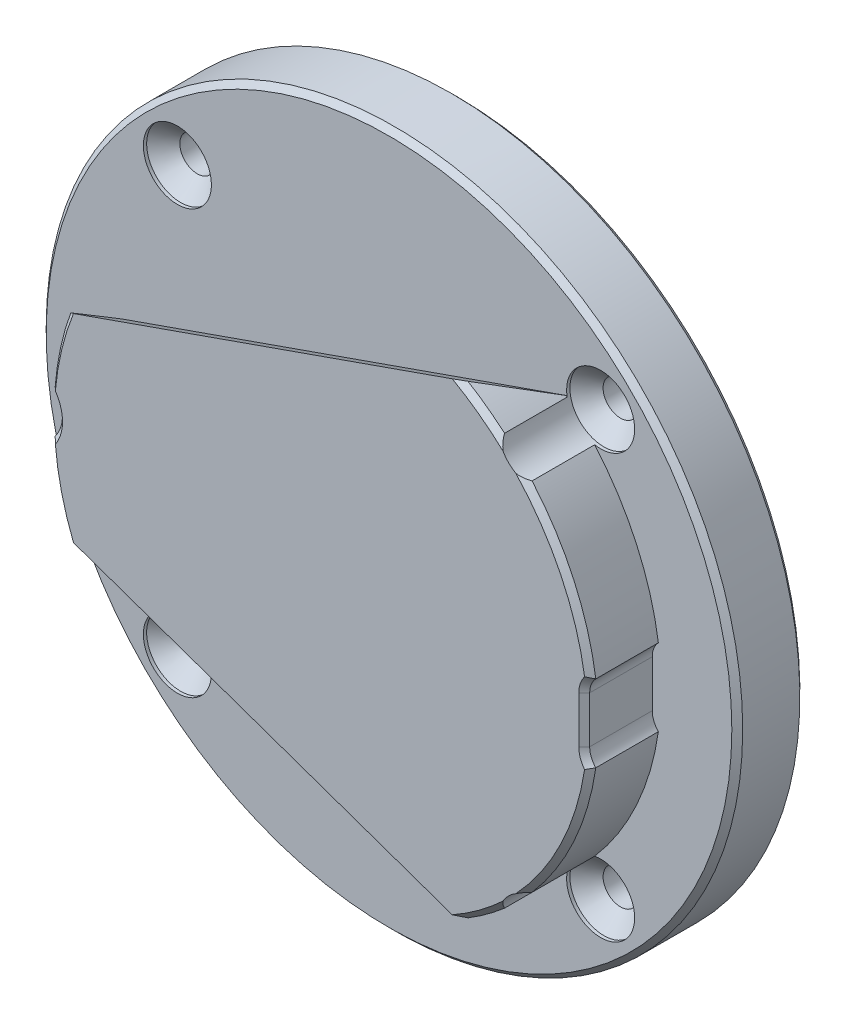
ISO-10303-21;
HEADER;
FILE_DESCRIPTION(('STEP AP214'),'2;1');
FILE_NAME('part.step','',(''),(''),'','','');
FILE_SCHEMA(('AUTOMOTIVE_DESIGN { 1 0 10303 214 1 1 1 1 }'));
ENDSEC;
DATA;
#1=APPLICATION_CONTEXT('core data for automotive mechanical design processes');
#2=APPLICATION_PROTOCOL_DEFINITION('international standard','automotive_design',2000,#1);
#3=PRODUCT_CONTEXT('',#1,'mechanical');
#4=PRODUCT('Part','Part','',(#3));
#5=PRODUCT_RELATED_PRODUCT_CATEGORY('part','',(#4));
#6=PRODUCT_DEFINITION_FORMATION('','',#4);
#7=PRODUCT_DEFINITION_CONTEXT('part definition',#1,'design');
#8=PRODUCT_DEFINITION('design','',#6,#7);
#9=PRODUCT_DEFINITION_SHAPE('','',#8);
#10=(LENGTH_UNIT() NAMED_UNIT(*) SI_UNIT(.MILLI.,.METRE.));
#11=(NAMED_UNIT(*) PLANE_ANGLE_UNIT() SI_UNIT($,.RADIAN.));
#12=(NAMED_UNIT(*) SI_UNIT($,.STERADIAN.) SOLID_ANGLE_UNIT());
#13=UNCERTAINTY_MEASURE_WITH_UNIT(LENGTH_MEASURE(1.E-05),#10,'distance_accuracy_value','');
#14=(GEOMETRIC_REPRESENTATION_CONTEXT(3) GLOBAL_UNCERTAINTY_ASSIGNED_CONTEXT((#13)) GLOBAL_UNIT_ASSIGNED_CONTEXT((#10,
#11,#12)) REPRESENTATION_CONTEXT('',''));
#15=CARTESIAN_POINT('',(0.,0.,0.));
#16=DIRECTION('',(0.,0.,1.));
#17=DIRECTION('',(1.,0.,0.));
#18=AXIS2_PLACEMENT_3D('',#15,#16,#17);
#19=CARTESIAN_POINT('',(0.,0.,24.));
#20=DIRECTION('',(0.,0.,-1.));
#21=DIRECTION('',(1.,0.,0.));
#22=AXIS2_PLACEMENT_3D('',#19,#20,#21);
#23=CONICAL_SURFACE('',#22,50.,0.785398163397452);
#24=CARTESIAN_POINT('',(0.,0.,25.));
#25=DIRECTION('',(0.,0.,-1.));
#26=DIRECTION('',(1.,0.,0.));
#27=AXIS2_PLACEMENT_3D('',#24,#25,#26);
#28=CIRCLE('',#27,49.);
#29=CARTESIAN_POINT('',(35.7963715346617,-33.4607200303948,25.));
#30=VERTEX_POINT('',#29);
#31=CARTESIAN_POINT('',(48.4413110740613,-7.37830477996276,25.));
#32=VERTEX_POINT('',#31);
#33=EDGE_CURVE('E181',#30,#32,#28,.F.);
#34=ORIENTED_EDGE('',*,*,#33,.F.);
#35=CARTESIAN_POINT('',(35.7957855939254,-33.4610539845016,25.0002));
#36=CARTESIAN_POINT('',(35.9312403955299,-33.3838387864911,24.9539765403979));
#37=CARTESIAN_POINT('',(36.0679208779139,-33.3126483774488,24.9020619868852));
#38=CARTESIAN_POINT('',(36.3424890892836,-33.1819920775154,24.7881995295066));
#39=CARTESIAN_POINT('',(36.4803751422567,-33.122511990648,24.7262639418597));
#40=CARTESIAN_POINT('',(36.8900161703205,-32.9626341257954,24.529397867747));
#41=CARTESIAN_POINT('',(37.1622002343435,-32.8783363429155,24.3818270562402));
#42=CARTESIAN_POINT('',(37.4914610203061,-32.7992380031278,24.1863763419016));
#43=CARTESIAN_POINT('',(37.5516390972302,-32.7857336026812,24.1499495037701));
#44=CARTESIAN_POINT('',(37.6718922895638,-32.7605908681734,24.0758036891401));
#45=CARTESIAN_POINT('',(37.7319662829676,-32.7489593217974,24.0380805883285));
#46=CARTESIAN_POINT('',(37.7918878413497,-32.7382530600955,23.9998));
#47=B_SPLINE_CURVE_WITH_KNOTS('',3,(#35,#36,#37,#38,#39,#40,#41,#42,#43,#44,#45,#46),
.UNSPECIFIED.,.F.,.F.,(4,2,2,2,2,4),(0.,0.4872876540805,0.973980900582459,1.93162304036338,
2.14650814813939,2.3621553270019),.UNSPECIFIED.);
#48=CARTESIAN_POINT('',(37.7915747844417,-32.7383089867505,24.0000000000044));
#49=VERTEX_POINT('',#48);
#50=EDGE_CURVE('E161',#30,#49,#47,.T.);
#51=ORIENTED_EDGE('',*,*,#50,.T.);
#52=CARTESIAN_POINT('',(0.,0.,24.));
#53=DIRECTION('',(0.,0.,1.));
#54=DIRECTION('',(-1.,0.,0.));
#55=AXIS2_PLACEMENT_3D('',#52,#53,#54);
#56=CIRCLE('',#55,50.);
#57=CARTESIAN_POINT('',(49.4975621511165,-7.07045550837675,24.0000000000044));
#58=VERTEX_POINT('',#57);
#59=EDGE_CURVE('E404',#58,#49,#56,.F.);
#60=ORIENTED_EDGE('',*,*,#59,.F.);
#61=CARTESIAN_POINT('',(49.4975621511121,-7.07045550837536,24.0000000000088));
#62=CARTESIAN_POINT('',(49.4098575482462,-7.09883563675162,24.0828098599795));
#63=CARTESIAN_POINT('',(49.3220559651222,-7.12645947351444,24.1657738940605));
#64=CARTESIAN_POINT('',(49.1462941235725,-7.1803070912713,24.3319671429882));
#65=CARTESIAN_POINT('',(49.0583338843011,-7.20653103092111,24.4151963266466));
#66=CARTESIAN_POINT('',(48.8822725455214,-7.25769706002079,24.5818932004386));
#67=CARTESIAN_POINT('',(48.7941714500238,-7.28263918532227,24.6653608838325));
#68=CARTESIAN_POINT('',(48.6178348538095,-7.33133836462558,24.8325208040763));
#69=CARTESIAN_POINT('',(48.5295993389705,-7.3550952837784,24.9162130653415));
#70=CARTESIAN_POINT('',(48.4413110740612,-7.37830477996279,25.));
#71=B_SPLINE_CURVE_WITH_KNOTS('',3,(#61,#62,#63,#64,#65,#66,#67,#68,#69,#70),.UNSPECIFIED.,.F.,
.F.,(4,2,2,2,4),(0.,0.371741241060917,0.743440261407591,1.11512887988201,1.48685969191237),.UNSPECIFIED.);
#72=EDGE_CURVE('E194',#58,#32,#71,.T.);
#73=ORIENTED_EDGE('',*,*,#72,.T.);
#74=EDGE_LOOP('',(#34,#51,#60,#73));
#75=FACE_BOUND('',#74,.T.);
#76=ADVANCED_FACE('F14',(#75),#23,.T.);
#77=CARTESIAN_POINT('',(32.7383089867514,-37.7915747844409,24.0000000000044));
#78=VERTEX_POINT('',#77);
#79=CARTESIAN_POINT('',(26.0126281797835,-42.7006226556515,24.));
#80=VERTEX_POINT('',#79);
#81=EDGE_CURVE('E173',#78,#80,#56,.F.);
#82=ORIENTED_EDGE('',*,*,#81,.F.);
#83=CARTESIAN_POINT('',(32.7382530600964,-37.7918878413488,23.9998));
#84=CARTESIAN_POINT('',(32.762413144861,-37.6566441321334,24.0861999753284));
#85=CARTESIAN_POINT('',(32.791346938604,-37.5204117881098,24.1698847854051));
#86=CARTESIAN_POINT('',(32.8594581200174,-37.2463260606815,24.3309026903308));
#87=CARTESIAN_POINT('',(32.8986593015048,-37.1084696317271,24.4082204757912));
#88=CARTESIAN_POINT('',(32.9870550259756,-36.8347297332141,24.5537864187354));
#89=CARTESIAN_POINT('',(33.0360477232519,-36.6988579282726,24.6221778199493));
#90=CARTESIAN_POINT('',(33.1449285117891,-36.4275531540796,24.7502722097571));
#91=CARTESIAN_POINT('',(33.2048025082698,-36.2921198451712,24.8099862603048));
#92=CARTESIAN_POINT('',(33.2997327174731,-36.0969176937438,24.8893520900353));
#93=CARTESIAN_POINT('',(33.3303053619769,-36.0365403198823,24.9129612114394));
#94=CARTESIAN_POINT('',(33.3938750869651,-35.9159478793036,24.9581601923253));
#95=CARTESIAN_POINT('',(33.4268818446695,-35.8557345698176,24.9797411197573));
#96=CARTESIAN_POINT('',(33.4610539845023,-35.7957855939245,25.0002));
#97=B_SPLINE_CURVE_WITH_KNOTS('',3,(#83,#84,#85,#86,#87,#88,#89,#90,#91,#92,#93,#94,#95,#96),
.UNSPECIFIED.,.F.,.F.,(4,2,2,2,2,2,4),(0.,0.486924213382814,0.974986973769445,1.4538692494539,
1.9321355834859,2.14710549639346,2.36298164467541),.UNSPECIFIED.);
#98=CARTESIAN_POINT('',(33.4607200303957,-35.7963715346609,25.));
#99=VERTEX_POINT('',#98);
#100=EDGE_CURVE('E159',#78,#99,#97,.T.);
#101=ORIENTED_EDGE('',*,*,#100,.T.);
#102=CARTESIAN_POINT('',(24.1242545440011,-42.6499747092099,25.));
#103=VERTEX_POINT('',#102);
#104=EDGE_CURVE('E171',#103,#99,#28,.F.);
#105=ORIENTED_EDGE('',*,*,#104,.F.);
#106=CARTESIAN_POINT('',(26.0126281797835,-42.7006226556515,24.));
#107=CARTESIAN_POINT('',(25.062004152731,-42.6803222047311,24.5119014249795));
#108=CARTESIAN_POINT('',(24.124254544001,-42.6499747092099,25.));
#109=B_SPLINE_CURVE_WITH_KNOTS('',2,(#106,#107,#108),.UNSPECIFIED.,.F.,.F.,(3,3),(0.,1.),.UNSPECIFIED.);
#110=EDGE_CURVE('E457',#80,#103,#109,.T.);
#111=ORIENTED_EDGE('',*,*,#110,.F.);
#112=EDGE_LOOP('',(#82,#101,#105,#111));
#113=FACE_BOUND('',#112,.T.);
#114=ADVANCED_FACE('F169',(#113),#23,.T.);
#115=CARTESIAN_POINT('',(0.,0.,12.5));
#116=DIRECTION('',(0.,0.,1.));
#117=DIRECTION('',(-1.,0.,0.));
#118=AXIS2_PLACEMENT_3D('',#115,#116,#117);
#119=CYLINDRICAL_SURFACE('',#118,50.);
#120=ORIENTED_EDGE('',*,*,#59,.T.);
#121=DIRECTION('',(0.,0.,-1.));
#122=VECTOR('',#121,1.);
#123=CARTESIAN_POINT('',(37.7915747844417,-32.7383089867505,18.45));
#124=LINE('',#123,#122);
#125=CARTESIAN_POINT('',(37.7915747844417,-32.7383089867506,12.5));
#126=VERTEX_POINT('',#125);
#127=EDGE_CURVE('E174',#49,#126,#124,.T.);
#128=ORIENTED_EDGE('',*,*,#127,.T.);
#129=CARTESIAN_POINT('',(0.,0.,12.5));
#130=DIRECTION('',(0.,0.,1.));
#131=DIRECTION('',(-1.,0.,0.));
#132=AXIS2_PLACEMENT_3D('',#129,#130,#131);
#133=CIRCLE('',#132,50.);
#134=CARTESIAN_POINT('',(49.4975621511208,-7.07045550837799,12.5));
#135=VERTEX_POINT('',#134);
#136=EDGE_CURVE('E383',#126,#135,#133,.T.);
#137=ORIENTED_EDGE('',*,*,#136,.T.);
#138=DIRECTION('',(0.,0.,1.));
#139=VECTOR('',#138,1.);
#140=CARTESIAN_POINT('',(49.497562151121,-7.07045550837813,-170.329529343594));
#141=LINE('',#140,#139);
#142=EDGE_CURVE('E360',#135,#58,#141,.T.);
#143=ORIENTED_EDGE('',*,*,#142,.T.);
#144=EDGE_LOOP('',(#120,#128,#137,#143));
#145=FACE_BOUND('',#144,.T.);
#146=ADVANCED_FACE('F474',(#145),#119,.T.);
#147=CARTESIAN_POINT('',(32.5467180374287,-37.9567009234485,12.5));
#148=VERTEX_POINT('',#147);
#149=CARTESIAN_POINT('',(32.7383089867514,-37.7915747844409,12.5));
#150=VERTEX_POINT('',#149);
#151=EDGE_CURVE('E380',#148,#150,#133,.T.);
#152=ORIENTED_EDGE('',*,*,#151,.T.);
#153=DIRECTION('',(0.,0.,-1.));
#154=VECTOR('',#153,1.);
#155=CARTESIAN_POINT('',(32.7383089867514,-37.7915747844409,18.45));
#156=LINE('',#155,#154);
#157=EDGE_CURVE('E29',#150,#78,#156,.F.);
#158=ORIENTED_EDGE('',*,*,#157,.T.);
#159=ORIENTED_EDGE('',*,*,#81,.T.);
#160=CARTESIAN_POINT('',(0.,0.,-30.8739189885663));
#161=DIRECTION('',(-0.28669600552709,-0.817193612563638,-0.5));
#162=DIRECTION('',(-0.165524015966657,-0.471806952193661,0.866025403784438));
#163=AXIS2_PLACEMENT_3D('',#160,#161,#162);
#164=ELLIPSE('',#163,100.,50.);
#165=EDGE_CURVE('E401',#80,#148,#164,.F.);
#166=ORIENTED_EDGE('',*,*,#165,.T.);
#167=EDGE_LOOP('',(#152,#158,#159,#166));
#168=FACE_BOUND('',#167,.T.);
#169=ADVANCED_FACE('F292',(#168),#119,.T.);
#170=CARTESIAN_POINT('',(0.,0.,23.9999999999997));
#171=DIRECTION('',(0.,0.,-1.));
#172=DIRECTION('',(0.,-1.,0.));
#173=AXIS2_PLACEMENT_3D('',#170,#171,#172);
#174=CONICAL_SURFACE('',#173,50.,0.785398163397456);
#175=CARTESIAN_POINT('',(0.,0.,24.));
#176=DIRECTION('',(0.,0.,1.));
#177=DIRECTION('',(-1.,0.,0.));
#178=AXIS2_PLACEMENT_3D('',#175,#176,#177);
#179=CIRCLE('',#178,50.);
#180=CARTESIAN_POINT('',(37.7915747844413,32.7383089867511,24.0000000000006));
#181=VERTEX_POINT('',#180);
#182=CARTESIAN_POINT('',(49.4975621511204,7.07045550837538,24.0000000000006));
#183=VERTEX_POINT('',#182);
#184=EDGE_CURVE('E352',#181,#183,#179,.F.);
#185=ORIENTED_EDGE('',*,*,#184,.F.);
#186=CARTESIAN_POINT('',(39.3569480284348,32.6582752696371,22.8577249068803));
#187=CARTESIAN_POINT('',(39.1988529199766,32.6464778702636,22.9869133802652));
#188=CARTESIAN_POINT('',(39.038438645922,32.640509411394,23.1139331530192));
#189=CARTESIAN_POINT('',(38.7130441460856,32.6412731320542,23.3626498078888));
#190=CARTESIAN_POINT('',(38.5480549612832,32.6480322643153,23.4843348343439));
#191=CARTESIAN_POINT('',(38.2122391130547,32.6755180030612,23.7222677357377));
#192=CARTESIAN_POINT('',(38.0413659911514,32.6964124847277,23.8384320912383));
#193=CARTESIAN_POINT('',(37.6966570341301,32.753537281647,24.0618972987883));
#194=CARTESIAN_POINT('',(37.5228239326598,32.7897541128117,24.1692058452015));
#195=CARTESIAN_POINT('',(37.1010931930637,32.897219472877,24.414981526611));
#196=CARTESIAN_POINT('',(36.85204526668,32.9767425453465,24.5481894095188));
#197=CARTESIAN_POINT('',(36.4796082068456,33.123199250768,24.7263361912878));
#198=CARTESIAN_POINT('',(36.3558371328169,33.1764463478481,24.7820399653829));
#199=CARTESIAN_POINT('',(36.1093405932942,33.2922936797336,24.8853846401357));
#200=CARTESIAN_POINT('',(35.9866145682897,33.3548885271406,24.9330301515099));
#201=CARTESIAN_POINT('',(35.753967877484,33.4836177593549,25.0154683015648));
#202=CARTESIAN_POINT('',(35.6438742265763,33.5489501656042,25.0510247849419));
#203=CARTESIAN_POINT('',(35.4263259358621,33.6874103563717,25.1139021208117));
#204=CARTESIAN_POINT('',(35.3188699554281,33.7605340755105,25.1412272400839));
#205=CARTESIAN_POINT('',(35.1074531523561,33.9143945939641,25.1870626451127));
#206=CARTESIAN_POINT('',(35.0034948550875,33.9951367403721,25.2055666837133));
#207=CARTESIAN_POINT('',(34.800176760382,34.1637026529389,25.2332732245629));
#208=CARTESIAN_POINT('',(34.7008167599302,34.2515261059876,25.2424761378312));
#209=CARTESIAN_POINT('',(34.5076962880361,34.4335348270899,25.2513400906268));
#210=CARTESIAN_POINT('',(34.4139344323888,34.5277185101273,25.2510034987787));
#211=CARTESIAN_POINT('',(34.2328326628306,34.721609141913,25.240801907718));
#212=CARTESIAN_POINT('',(34.1454937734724,34.8213169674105,25.230935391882));
#213=CARTESIAN_POINT('',(33.9780800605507,35.0250832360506,25.2019547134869));
#214=CARTESIAN_POINT('',(33.8979936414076,35.1291343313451,25.1828556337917));
#215=CARTESIAN_POINT('',(33.7454219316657,35.3406858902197,25.1358911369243));
#216=CARTESIAN_POINT('',(33.6729322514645,35.4481843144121,25.1080308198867));
#217=CARTESIAN_POINT('',(33.5794412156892,35.5964261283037,25.0645080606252));
#218=CARTESIAN_POINT('',(33.5550346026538,35.6361094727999,25.0523683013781));
#219=CARTESIAN_POINT('',(33.5072651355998,35.7157473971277,25.0270540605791));
#220=CARTESIAN_POINT('',(33.4839018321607,35.7557018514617,25.0138800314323));
#221=CARTESIAN_POINT('',(33.3847238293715,35.92969747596,24.9544977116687));
#222=CARTESIAN_POINT('',(33.3141466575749,36.0650523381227,24.9031479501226));
#223=CARTESIAN_POINT('',(33.1844100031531,36.337135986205,24.7905200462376));
#224=CARTESIAN_POINT('',(33.1252625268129,36.4738660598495,24.7292315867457));
#225=CARTESIAN_POINT('',(32.9642346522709,36.8848829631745,24.532172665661));
#226=CARTESIAN_POINT('',(32.8789404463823,37.1596876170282,24.383318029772));
#227=CARTESIAN_POINT('',(32.7991982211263,37.491626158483,24.1862784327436));
#228=CARTESIAN_POINT('',(32.7856605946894,37.5519661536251,24.1497513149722));
#229=CARTESIAN_POINT('',(32.7605259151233,37.6722251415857,24.075594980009));
#230=CARTESIAN_POINT('',(32.7489251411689,37.7321447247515,24.0379680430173));
#231=CARTESIAN_POINT('',(32.7081762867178,37.9602598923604,23.8922322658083));
#232=CARTESIAN_POINT('',(32.6854757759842,38.1272303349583,23.7803667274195));
#233=CARTESIAN_POINT('',(32.653632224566,38.458371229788,23.5491142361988));
#234=CARTESIAN_POINT('',(32.6445512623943,38.6225255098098,23.4296954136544));
#235=CARTESIAN_POINT('',(32.6417780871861,38.7845094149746,23.307556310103));
#236=B_SPLINE_CURVE_WITH_KNOTS('',3,(#186,#187,#188,#189,#190,#191,#192,#193,#194,#195,#196,
#197,#198,#199,#200,#201,#202,#203,#204,#205,#206,#207,#208,#209,#210,#211,#212,#213,#214,#215,
#216,#217,#218,#219,#220,#221,#222,#223,#224,#225,#226,#227,#228,#229,#230,#231,#232,#233,#234,
#235),.UNSPECIFIED.,.F.,.F.,(4,2,2,2,2,2,2,2,2,2,2,2,2,2,2,2,2,2,2,2,2,2,2,2,4),(0.,
0.613536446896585,1.22837361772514,1.85064400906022,2.47236792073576,3.34895166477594,
3.78592985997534,4.22265717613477,4.62077982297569,5.01869574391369,5.41689305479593,
5.81507276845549,6.21315361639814,6.61129782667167,7.00879379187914,7.40605879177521,
7.55047285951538,7.69482410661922,8.17707316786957,8.65982608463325,9.62642654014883,
9.8419020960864,10.0569588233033,10.6630460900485,11.2718876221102),.UNSPECIFIED.);
#237=CARTESIAN_POINT('',(35.7963715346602,33.4607200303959,25.));
#238=VERTEX_POINT('',#237);
#239=EDGE_CURVE('E203',#181,#238,#236,.T.);
#240=ORIENTED_EDGE('',*,*,#239,.T.);
#241=CARTESIAN_POINT('',(0.,0.,25.));
#242=DIRECTION('',(0.,0.,-1.));
#243=DIRECTION('',(0.,-1.,0.));
#244=AXIS2_PLACEMENT_3D('',#241,#242,#243);
#245=CIRCLE('',#244,49.);
#246=CARTESIAN_POINT('',(48.4413110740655,7.37830477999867,24.9999999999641));
#247=VERTEX_POINT('',#246);
#248=EDGE_CURVE('E306',#238,#247,#245,.T.);
#249=ORIENTED_EDGE('',*,*,#248,.T.);
#250=CARTESIAN_POINT('',(48.4413110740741,7.37830478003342,24.9999999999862));
#251=CARTESIAN_POINT('',(48.5295993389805,7.35509528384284,24.9162130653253));
#252=CARTESIAN_POINT('',(48.6178348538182,7.33133836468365,24.8325208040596));
#253=CARTESIAN_POINT('',(48.7941714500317,7.28263918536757,24.6653608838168));
#254=CARTESIAN_POINT('',(48.8822725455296,7.25769706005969,24.5818932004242));
#255=CARTESIAN_POINT('',(49.0583338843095,7.20653103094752,24.4151963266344));
#256=CARTESIAN_POINT('',(49.1462941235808,7.18030709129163,24.3319671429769));
#257=CARTESIAN_POINT('',(49.3220559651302,7.12645947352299,24.1657738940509));
#258=CARTESIAN_POINT('',(49.4098575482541,7.09883563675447,24.0828098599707));
#259=CARTESIAN_POINT('',(49.4975621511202,7.07045550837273,24.0000000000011));
#260=B_SPLINE_CURVE_WITH_KNOTS('',3,(#250,#251,#252,#253,#254,#255,#256,#257,#258,#259),
.UNSPECIFIED.,.F.,.F.,(4,2,2,2,4),(0.,0.37173081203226,0.743419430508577,1.11511845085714,
1.48685969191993),.UNSPECIFIED.);
#261=EDGE_CURVE('E299',#247,#183,#260,.T.);
#262=ORIENTED_EDGE('',*,*,#261,.T.);
#263=EDGE_LOOP('',(#185,#240,#249,#262));
#264=FACE_BOUND('',#263,.T.);
#265=ADVANCED_FACE('F286',(#264),#174,.T.);
#266=CARTESIAN_POINT('',(24.1242545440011,42.6499747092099,25.));
#267=VERTEX_POINT('',#266);
#268=CARTESIAN_POINT('',(33.4607200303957,35.7963715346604,25.));
#269=VERTEX_POINT('',#268);
#270=EDGE_CURVE('E307',#267,#269,#245,.T.);
#271=ORIENTED_EDGE('',*,*,#270,.T.);
#272=CARTESIAN_POINT('',(32.7383089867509,37.7915747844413,24.0000000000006));
#273=VERTEX_POINT('',#272);
#274=EDGE_CURVE('E273',#269,#273,#236,.T.);
#275=ORIENTED_EDGE('',*,*,#274,.T.);
#276=CARTESIAN_POINT('',(26.0126281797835,42.7006226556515,24.));
#277=VERTEX_POINT('',#276);
#278=EDGE_CURVE('E354',#277,#273,#179,.F.);
#279=ORIENTED_EDGE('',*,*,#278,.F.);
#280=CARTESIAN_POINT('',(24.1242545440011,42.6499747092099,25.));
#281=CARTESIAN_POINT('',(25.0620041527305,42.6803222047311,24.5119014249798));
#282=CARTESIAN_POINT('',(26.0126281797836,42.7006226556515,24.));
#283=B_SPLINE_CURVE_WITH_KNOTS('',2,(#280,#281,#282),.UNSPECIFIED.,.F.,.F.,(3,3),(0.,1.),.UNSPECIFIED.);
#284=EDGE_CURVE('E400',#267,#277,#283,.T.);
#285=ORIENTED_EDGE('',*,*,#284,.F.);
#286=EDGE_LOOP('',(#271,#275,#279,#285));
#287=FACE_BOUND('',#286,.T.);
#288=ADVANCED_FACE('F291',(#287),#174,.T.);
#289=CARTESIAN_POINT('',(0.,0.,12.5));
#290=DIRECTION('',(0.,0.,1.));
#291=DIRECTION('',(-1.,0.,0.));
#292=AXIS2_PLACEMENT_3D('',#289,#290,#291);
#293=CYLINDRICAL_SURFACE('',#292,50.);
#294=ORIENTED_EDGE('',*,*,#278,.T.);
#295=DIRECTION('',(0.,0.,-1.));
#296=VECTOR('',#295,1.);
#297=CARTESIAN_POINT('',(32.7383089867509,37.7915747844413,18.45));
#298=LINE('',#297,#296);
#299=CARTESIAN_POINT('',(32.7383089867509,37.7915747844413,12.5));
#300=VERTEX_POINT('',#299);
#301=EDGE_CURVE('E282',#273,#300,#298,.T.);
#302=ORIENTED_EDGE('',*,*,#301,.T.);
#303=CARTESIAN_POINT('',(0.,0.,12.5));
#304=DIRECTION('',(0.,0.,1.));
#305=DIRECTION('',(-1.,0.,0.));
#306=AXIS2_PLACEMENT_3D('',#303,#304,#305);
#307=CIRCLE('',#306,50.);
#308=CARTESIAN_POINT('',(32.5467180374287,37.9567009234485,12.5));
#309=VERTEX_POINT('',#308);
#310=EDGE_CURVE('E375',#300,#309,#307,.T.);
#311=ORIENTED_EDGE('',*,*,#310,.T.);
#312=CARTESIAN_POINT('',(0.,0.,-30.8739189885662));
#313=DIRECTION('',(-0.286696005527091,0.817193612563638,-0.5));
#314=DIRECTION('',(-0.165524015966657,0.47180695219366,0.866025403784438));
#315=AXIS2_PLACEMENT_3D('',#312,#313,#314);
#316=ELLIPSE('',#315,100.,50.);
#317=EDGE_CURVE('E396',#277,#309,#316,.T.);
#318=ORIENTED_EDGE('',*,*,#317,.F.);
#319=EDGE_LOOP('',(#294,#302,#311,#318));
#320=FACE_BOUND('',#319,.T.);
#321=ADVANCED_FACE('F529',(#320),#293,.T.);
#322=CARTESIAN_POINT('',(49.4975621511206,7.07045550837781,12.5));
#323=VERTEX_POINT('',#322);
#324=CARTESIAN_POINT('',(37.7915747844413,32.7383089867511,12.5));
#325=VERTEX_POINT('',#324);
#326=EDGE_CURVE('E372',#323,#325,#307,.T.);
#327=ORIENTED_EDGE('',*,*,#326,.T.);
#328=DIRECTION('',(0.,0.,-1.));
#329=VECTOR('',#328,1.);
#330=CARTESIAN_POINT('',(37.7915747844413,32.7383089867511,18.45));
#331=LINE('',#330,#329);
#332=EDGE_CURVE('E37',#325,#181,#331,.F.);
#333=ORIENTED_EDGE('',*,*,#332,.T.);
#334=ORIENTED_EDGE('',*,*,#184,.T.);
#335=DIRECTION('',(0.,0.,1.));
#336=VECTOR('',#335,1.);
#337=CARTESIAN_POINT('',(49.4975621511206,7.07045550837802,12.5));
#338=LINE('',#337,#336);
#339=EDGE_CURVE('E351',#183,#323,#338,.F.);
#340=ORIENTED_EDGE('',*,*,#339,.T.);
#341=EDGE_LOOP('',(#327,#333,#334,#340));
#342=FACE_BOUND('',#341,.T.);
#343=ADVANCED_FACE('F533',(#342),#293,.T.);
#344=CARTESIAN_POINT('',(0.,0.,24.));
#345=DIRECTION('',(0.,0.,-1.));
#346=DIRECTION('',(1.,0.,0.));
#347=AXIS2_PLACEMENT_3D('',#344,#345,#346);
#348=CONICAL_SURFACE('',#347,50.,0.785398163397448);
#349=CARTESIAN_POINT('',(-48.8159090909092,-4.24346787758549,25.));
#350=CARTESIAN_POINT('',(-48.9016990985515,-4.22088925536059,24.9164876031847));
#351=CARTESIAN_POINT('',(-48.9874480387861,-4.19800582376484,24.8330151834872));
#352=CARTESIAN_POINT('',(-49.1588542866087,-4.15160010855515,24.6661595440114));
#353=CARTESIAN_POINT('',(-49.2445115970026,-4.12807784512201,24.5827763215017));
#354=CARTESIAN_POINT('',(-49.4157309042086,-4.08036369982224,24.4161026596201));
#355=CARTESIAN_POINT('',(-49.5012929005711,-4.05617181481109,24.3328122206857));
#356=CARTESIAN_POINT('',(-49.672315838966,-4.00708343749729,24.1663297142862));
#357=CARTESIAN_POINT('',(-49.757776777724,-3.98218692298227,24.0831376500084));
#358=CARTESIAN_POINT('',(-49.8431818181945,-3.95692130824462,23.9999999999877));
#359=B_SPLINE_CURVE_WITH_KNOTS('',3,(#349,#350,#351,#352,#353,#354,#355,#356,#357,#358),
.UNSPECIFIED.,.F.,.F.,(4,2,2,2,4),(0.,0.365508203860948,0.731004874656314,1.09650326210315,
1.46201318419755),.UNSPECIFIED.);
#360=CARTESIAN_POINT('',(-48.8159090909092,-4.24346787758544,25.));
#361=VERTEX_POINT('',#360);
#362=CARTESIAN_POINT('',(-49.8431818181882,-3.95692130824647,23.9999999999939));
#363=VERTEX_POINT('',#362);
#364=EDGE_CURVE('E409',#361,#363,#359,.T.);
#365=ORIENTED_EDGE('',*,*,#364,.T.);
#366=CARTESIAN_POINT('',(0.,0.,24.));
#367=DIRECTION('',(0.,0.,1.));
#368=DIRECTION('',(-1.,0.,0.));
#369=AXIS2_PLACEMENT_3D('',#366,#367,#368);
#370=CIRCLE('',#369,50.);
#371=CARTESIAN_POINT('',(-46.988806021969,-17.08953213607,24.));
#372=VERTEX_POINT('',#371);
#373=EDGE_CURVE('E415',#372,#363,#370,.F.);
#374=ORIENTED_EDGE('',*,*,#373,.F.);
#375=CARTESIAN_POINT('',(-45.4826937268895,-18.2297715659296,25.));
#376=CARTESIAN_POINT('',(-46.2338621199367,-17.6675960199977,24.5119014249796));
#377=CARTESIAN_POINT('',(-46.988806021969,-17.08953213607,24.0000000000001));
#378=B_SPLINE_CURVE_WITH_KNOTS('',2,(#375,#376,#377),.UNSPECIFIED.,.F.,.F.,(3,3),(0.,1.),.UNSPECIFIED.);
#379=CARTESIAN_POINT('',(-45.4826937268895,-18.2297715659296,25.));
#380=VERTEX_POINT('',#379);
#381=EDGE_CURVE('E408',#380,#372,#378,.T.);
#382=ORIENTED_EDGE('',*,*,#381,.F.);
#383=CARTESIAN_POINT('',(0.,0.,25.));
#384=DIRECTION('',(0.,0.,-1.));
#385=DIRECTION('',(1.,0.,0.));
#386=AXIS2_PLACEMENT_3D('',#383,#384,#385);
#387=CIRCLE('',#386,49.);
#388=EDGE_CURVE('E186',#361,#380,#387,.F.);
#389=ORIENTED_EDGE('',*,*,#388,.F.);
#390=EDGE_LOOP('',(#365,#374,#382,#389));
#391=FACE_BOUND('',#390,.T.);
#392=ADVANCED_FACE('F16',(#391),#348,.T.);
#393=CARTESIAN_POINT('',(52.3751480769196,-4.2920568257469,25.));
#394=DIRECTION('',(0.,0.,1.));
#395=DIRECTION('',(-1.,0.,0.));
#396=AXIS2_PLACEMENT_3D('',#393,#394,#395);
#397=CONICAL_SURFACE('',#396,4.99999999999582,0.785398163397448);
#398=CARTESIAN_POINT('',(52.3751480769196,-4.2920568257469,24.));
#399=DIRECTION('',(0.,0.,1.));
#400=DIRECTION('',(-1.,0.,0.));
#401=AXIS2_PLACEMENT_3D('',#398,#399,#400);
#402=CIRCLE('',#401,4.00000000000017);
#403=CARTESIAN_POINT('',(48.3751480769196,-4.2920568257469,24.));
#404=VERTEX_POINT('',#403);
#405=EDGE_CURVE('E332',#58,#404,#402,.F.);
#406=ORIENTED_EDGE('',*,*,#405,.T.);
#407=DIRECTION('',(0.707106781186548,0.,-0.707106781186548));
#408=VECTOR('',#407,1.);
#409=CARTESIAN_POINT('',(47.3751480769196,-4.2920568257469,25.));
#410=LINE('',#409,#408);
#411=CARTESIAN_POINT('',(47.3751480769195,-4.2920568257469,25.));
#412=VERTEX_POINT('',#411);
#413=EDGE_CURVE('E202',#404,#412,#410,.F.);
#414=ORIENTED_EDGE('',*,*,#413,.T.);
#415=CARTESIAN_POINT('',(52.3751480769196,-4.2920568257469,25.));
#416=DIRECTION('',(0.,0.,1.));
#417=DIRECTION('',(-1.,0.,0.));
#418=AXIS2_PLACEMENT_3D('',#415,#416,#417);
#419=CIRCLE('',#418,4.99999999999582);
#420=EDGE_CURVE('E180',#32,#412,#419,.F.);
#421=ORIENTED_EDGE('',*,*,#420,.F.);
#422=ORIENTED_EDGE('',*,*,#72,.F.);
#423=EDGE_LOOP('',(#406,#414,#421,#422));
#424=FACE_BOUND('',#423,.T.);
#425=ADVANCED_FACE('F205',(#424),#397,.F.);
#426=CARTESIAN_POINT('',(47.3751480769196,0.,25.));
#427=DIRECTION('',(-0.707106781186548,0.,-0.707106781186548));
#428=DIRECTION('',(0.707106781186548,0.,-0.707106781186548));
#429=AXIS2_PLACEMENT_3D('',#426,#427,#428);
#430=PLANE('',#429);
#431=DIRECTION('',(0.,1.,0.));
#432=VECTOR('',#431,1.);
#433=CARTESIAN_POINT('',(48.3751480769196,4.2920568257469,24.));
#434=LINE('',#433,#432);
#435=CARTESIAN_POINT('',(48.3751480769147,4.2920568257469,24.0000000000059));
#436=VERTEX_POINT('',#435);
#437=EDGE_CURVE('E323',#436,#404,#434,.F.);
#438=ORIENTED_EDGE('',*,*,#437,.F.);
#439=DIRECTION('',(0.707106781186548,0.,-0.707106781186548));
#440=VECTOR('',#439,1.);
#441=CARTESIAN_POINT('',(-498952.624851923,4.2920568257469,499025.));
#442=LINE('',#441,#440);
#443=CARTESIAN_POINT('',(47.3751480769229,4.2920568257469,24.9999999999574));
#444=VERTEX_POINT('',#443);
#445=EDGE_CURVE('E193',#436,#444,#442,.F.);
#446=ORIENTED_EDGE('',*,*,#445,.T.);
#447=DIRECTION('',(0.,-1.,0.));
#448=VECTOR('',#447,1.);
#449=CARTESIAN_POINT('',(47.3751480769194,0.,25.));
#450=LINE('',#449,#448);
#451=EDGE_CURVE('E184',#412,#444,#450,.F.);
#452=ORIENTED_EDGE('',*,*,#451,.F.);
#453=ORIENTED_EDGE('',*,*,#413,.F.);
#454=EDGE_LOOP('',(#438,#446,#452,#453));
#455=FACE_BOUND('',#454,.T.);
#456=ADVANCED_FACE('F312',(#455),#430,.F.);
#457=CARTESIAN_POINT('',(52.3751480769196,4.2920568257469,24.9999999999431));
#458=DIRECTION('',(0.,0.,1.));
#459=DIRECTION('',(-1.,0.,0.));
#460=AXIS2_PLACEMENT_3D('',#457,#458,#459);
#461=CONICAL_SURFACE('',#460,4.99999999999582,0.785398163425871);
#462=CARTESIAN_POINT('',(52.3751480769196,4.2920568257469,24.));
#463=DIRECTION('',(0.,0.,1.));
#464=DIRECTION('',(-1.,0.,0.));
#465=AXIS2_PLACEMENT_3D('',#462,#463,#464);
#466=CIRCLE('',#465,4.);
#467=EDGE_CURVE('E342',#436,#183,#466,.F.);
#468=ORIENTED_EDGE('',*,*,#467,.T.);
#469=ORIENTED_EDGE('',*,*,#261,.F.);
#470=CARTESIAN_POINT('',(52.3751480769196,4.2920568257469,24.9999999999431));
#471=DIRECTION('',(0.,0.,1.));
#472=DIRECTION('',(-1.,0.,0.));
#473=AXIS2_PLACEMENT_3D('',#470,#471,#472);
#474=CIRCLE('',#473,4.99999999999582);
#475=EDGE_CURVE('E190',#444,#247,#474,.F.);
#476=ORIENTED_EDGE('',*,*,#475,.F.);
#477=ORIENTED_EDGE('',*,*,#445,.F.);
#478=EDGE_LOOP('',(#468,#469,#476,#477));
#479=FACE_BOUND('',#478,.T.);
#480=ADVANCED_FACE('F309',(#479),#461,.F.);
#481=CARTESIAN_POINT('',(0.,0.,25.));
#482=DIRECTION('',(0.,0.,1.));
#483=DIRECTION('',(-1.,0.,0.));
#484=AXIS2_PLACEMENT_3D('',#481,#482,#483);
#485=PLANE('',#484);
#486=ORIENTED_EDGE('',*,*,#104,.T.);
#487=CARTESIAN_POINT('',(38.8908729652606,-38.8908729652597,25.));
#488=DIRECTION('',(0.,0.,-1.));
#489=DIRECTION('',(0.,1.,0.));
#490=AXIS2_PLACEMENT_3D('',#487,#488,#489);
#491=CIRCLE('',#490,6.25);
#492=EDGE_CURVE('E155',#99,#30,#491,.T.);
#493=ORIENTED_EDGE('',*,*,#492,.T.);
#494=ORIENTED_EDGE('',*,*,#33,.T.);
#495=ORIENTED_EDGE('',*,*,#420,.T.);
#496=ORIENTED_EDGE('',*,*,#451,.T.);
#497=ORIENTED_EDGE('',*,*,#475,.T.);
#498=ORIENTED_EDGE('',*,*,#248,.F.);
#499=CARTESIAN_POINT('',(38.89087296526,38.8908729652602,25.));
#500=DIRECTION('',(0.,0.,-1.));
#501=DIRECTION('',(-1.,0.,0.));
#502=AXIS2_PLACEMENT_3D('',#499,#500,#501);
#503=CIRCLE('',#502,6.25);
#504=EDGE_CURVE('E827',#238,#269,#503,.T.);
#505=ORIENTED_EDGE('',*,*,#504,.T.);
#506=ORIENTED_EDGE('',*,*,#270,.F.);
#507=DIRECTION('',(0.943613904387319,0.331048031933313,0.));
#508=VECTOR('',#507,1.);
#509=CARTESIAN_POINT('',(-45.4826937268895,18.2297715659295,25.));
#510=LINE('',#509,#508);
#511=CARTESIAN_POINT('',(-45.4826937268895,18.2297715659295,25.));
#512=VERTEX_POINT('',#511);
#513=EDGE_CURVE('E513',#512,#267,#510,.T.);
#514=ORIENTED_EDGE('',*,*,#513,.F.);
#515=CARTESIAN_POINT('',(0.,0.,25.));
#516=DIRECTION('',(0.,0.,-1.));
#517=DIRECTION('',(1.,0.,0.));
#518=AXIS2_PLACEMENT_3D('',#515,#516,#517);
#519=CIRCLE('',#518,49.);
#520=CARTESIAN_POINT('',(-48.8159090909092,4.24346787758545,25.));
#521=VERTEX_POINT('',#520);
#522=EDGE_CURVE('E432',#521,#512,#519,.T.);
#523=ORIENTED_EDGE('',*,*,#522,.F.);
#524=CARTESIAN_POINT('',(-55.,0.,25.));
#525=DIRECTION('',(0.,0.,1.));
#526=DIRECTION('',(-1.,0.,0.));
#527=AXIS2_PLACEMENT_3D('',#524,#525,#526);
#528=CIRCLE('',#527,7.5);
#529=EDGE_CURVE('E416',#521,#361,#528,.F.);
#530=ORIENTED_EDGE('',*,*,#529,.T.);
#531=ORIENTED_EDGE('',*,*,#388,.T.);
#532=DIRECTION('',(-0.943613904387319,0.331048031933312,0.));
#533=VECTOR('',#532,1.);
#534=CARTESIAN_POINT('',(24.1242545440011,-42.6499747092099,25.));
#535=LINE('',#534,#533);
#536=EDGE_CURVE('E178',#103,#380,#535,.T.);
#537=ORIENTED_EDGE('',*,*,#536,.F.);
#538=EDGE_LOOP('',(#486,#493,#494,#495,#496,#497,#498,#505,#506,#514,#523,#530,#531,#537));
#539=FACE_BOUND('',#538,.T.);
#540=ADVANCED_FACE('F176',(#539),#485,.T.);
#541=CARTESIAN_POINT('',(0.,0.,24.));
#542=DIRECTION('',(0.,0.,-1.));
#543=DIRECTION('',(1.,0.,0.));
#544=AXIS2_PLACEMENT_3D('',#541,#542,#543);
#545=CONICAL_SURFACE('',#544,50.,0.785398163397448);
#546=CARTESIAN_POINT('',(-49.8431818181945,3.95692130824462,23.9999999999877));
#547=CARTESIAN_POINT('',(-49.757776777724,3.98218692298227,24.0831376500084));
#548=CARTESIAN_POINT('',(-49.672315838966,4.00708343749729,24.1663297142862));
#549=CARTESIAN_POINT('',(-49.5012929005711,4.05617181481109,24.3328122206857));
#550=CARTESIAN_POINT('',(-49.4157309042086,4.08036369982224,24.4161026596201));
#551=CARTESIAN_POINT('',(-49.2445115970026,4.12807784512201,24.5827763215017));
#552=CARTESIAN_POINT('',(-49.1588542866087,4.15160010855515,24.6661595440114));
#553=CARTESIAN_POINT('',(-48.9874480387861,4.19800582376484,24.8330151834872));
#554=CARTESIAN_POINT('',(-48.9016990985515,4.22088925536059,24.9164876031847));
#555=CARTESIAN_POINT('',(-48.8159090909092,4.24346787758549,25.));
#556=B_SPLINE_CURVE_WITH_KNOTS('',3,(#546,#547,#548,#549,#550,#551,#552,#553,#554,#555),
.UNSPECIFIED.,.F.,.F.,(4,2,2,2,4),(0.,0.365509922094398,0.73100830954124,1.09650498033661,
1.46201318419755),.UNSPECIFIED.);
#557=CARTESIAN_POINT('',(-49.8431818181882,3.95692130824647,23.9999999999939));
#558=VERTEX_POINT('',#557);
#559=EDGE_CURVE('E426',#558,#521,#556,.T.);
#560=ORIENTED_EDGE('',*,*,#559,.T.);
#561=ORIENTED_EDGE('',*,*,#522,.T.);
#562=CARTESIAN_POINT('',(-46.988806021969,17.0895321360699,24.0000000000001));
#563=CARTESIAN_POINT('',(-46.2338621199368,17.6675960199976,24.5119014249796));
#564=CARTESIAN_POINT('',(-45.4826937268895,18.2297715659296,25.));
#565=B_SPLINE_CURVE_WITH_KNOTS('',2,(#562,#563,#564),.UNSPECIFIED.,.F.,.F.,(3,3),(0.,1.),.UNSPECIFIED.);
#566=CARTESIAN_POINT('',(-46.9888060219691,17.0895321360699,24.));
#567=VERTEX_POINT('',#566);
#568=EDGE_CURVE('E399',#567,#512,#565,.T.);
#569=ORIENTED_EDGE('',*,*,#568,.F.);
#570=CARTESIAN_POINT('',(0.,0.,24.));
#571=DIRECTION('',(0.,0.,1.));
#572=DIRECTION('',(-1.,0.,0.));
#573=AXIS2_PLACEMENT_3D('',#570,#571,#572);
#574=CIRCLE('',#573,50.);
#575=EDGE_CURVE('E395',#558,#567,#574,.F.);
#576=ORIENTED_EDGE('',*,*,#575,.F.);
#577=EDGE_LOOP('',(#560,#561,#569,#576));
#578=FACE_BOUND('',#577,.T.);
#579=ADVANCED_FACE('F294',(#578),#545,.T.);
#580=CARTESIAN_POINT('',(-55.,0.,25.));
#581=DIRECTION('',(0.,0.,1.));
#582=DIRECTION('',(-1.,0.,0.));
#583=AXIS2_PLACEMENT_3D('',#580,#581,#582);
#584=CONICAL_SURFACE('',#583,7.5,0.785398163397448);
#585=ORIENTED_EDGE('',*,*,#529,.F.);
#586=ORIENTED_EDGE('',*,*,#559,.F.);
#587=CARTESIAN_POINT('',(-55.,0.,24.));
#588=DIRECTION('',(0.,0.,-1.));
#589=DIRECTION('',(1.,0.,0.));
#590=AXIS2_PLACEMENT_3D('',#587,#588,#589);
#591=CIRCLE('',#590,6.5);
#592=EDGE_CURVE('E490',#558,#363,#591,.T.);
#593=ORIENTED_EDGE('',*,*,#592,.T.);
#594=ORIENTED_EDGE('',*,*,#364,.F.);
#595=EDGE_LOOP('',(#585,#586,#593,#594));
#596=FACE_BOUND('',#595,.T.);
#597=ADVANCED_FACE('F418',(#596),#584,.F.);
#598=CARTESIAN_POINT('',(0.,0.,11.5));
#599=DIRECTION('',(0.,0.,-1.));
#600=DIRECTION('',(1.,0.,0.));
#601=AXIS2_PLACEMENT_3D('',#598,#599,#600);
#602=CONICAL_SURFACE('',#601,64.,0.78539816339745);
#603=CARTESIAN_POINT('',(0.,0.,12.5));
#604=DIRECTION('',(0.,0.,-1.));
#605=DIRECTION('',(1.,0.,0.));
#606=AXIS2_PLACEMENT_3D('',#603,#604,#605);
#607=CIRCLE('',#606,63.);
#608=CARTESIAN_POINT('',(63.,0.,12.5));
#609=VERTEX_POINT('',#608);
#610=EDGE_CURVE('E387',#609,#609,#607,.T.);
#611=ORIENTED_EDGE('',*,*,#610,.T.);
#612=EDGE_LOOP('',(#611));
#613=FACE_BOUND('',#612,.T.);
#614=CARTESIAN_POINT('',(0.,0.,11.5));
#615=DIRECTION('',(0.,0.,1.));
#616=DIRECTION('',(-1.,0.,0.));
#617=AXIS2_PLACEMENT_3D('',#614,#615,#616);
#618=CIRCLE('',#617,64.);
#619=CARTESIAN_POINT('',(-64.,0.,11.5));
#620=VERTEX_POINT('',#619);
#621=EDGE_CURVE('E390',#620,#620,#618,.F.);
#622=ORIENTED_EDGE('',*,*,#621,.F.);
#623=EDGE_LOOP('',(#622));
#624=FACE_BOUND('',#623,.T.);
#625=ADVANCED_FACE('F422',(#613,#624),#602,.T.);
#626=CARTESIAN_POINT('',(0.,0.,12.5));
#627=DIRECTION('',(0.,0.,1.));
#628=DIRECTION('',(-1.,0.,0.));
#629=AXIS2_PLACEMENT_3D('',#626,#627,#628);
#630=CYLINDRICAL_SURFACE('',#629,50.);
#631=DIRECTION('',(0.,0.,-1.));
#632=VECTOR('',#631,1.);
#633=CARTESIAN_POINT('',(-49.8431818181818,-3.9569213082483,25.001));
#634=LINE('',#633,#632);
#635=CARTESIAN_POINT('',(-49.8431818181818,-3.9569213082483,12.5));
#636=VERTEX_POINT('',#635);
#637=EDGE_CURVE('E485',#363,#636,#634,.T.);
#638=ORIENTED_EDGE('',*,*,#637,.T.);
#639=CARTESIAN_POINT('',(0.,0.,12.5));
#640=DIRECTION('',(0.,0.,1.));
#641=DIRECTION('',(-1.,0.,0.));
#642=AXIS2_PLACEMENT_3D('',#639,#640,#641);
#643=CIRCLE('',#642,50.);
#644=CARTESIAN_POINT('',(-49.1268904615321,-9.30315180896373,12.5));
#645=VERTEX_POINT('',#644);
#646=EDGE_CURVE('E384',#636,#645,#643,.T.);
#647=ORIENTED_EDGE('',*,*,#646,.T.);
#648=CARTESIAN_POINT('',(0.,0.,-30.8739189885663));
#649=DIRECTION('',(-0.28669600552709,-0.817193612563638,-0.5));
#650=DIRECTION('',(-0.165524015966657,-0.471806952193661,0.866025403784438));
#651=AXIS2_PLACEMENT_3D('',#648,#649,#650);
#652=ELLIPSE('',#651,100.,50.);
#653=EDGE_CURVE('E405',#372,#645,#652,.T.);
#654=ORIENTED_EDGE('',*,*,#653,.F.);
#655=ORIENTED_EDGE('',*,*,#373,.T.);
#656=EDGE_LOOP('',(#638,#647,#654,#655));
#657=FACE_BOUND('',#656,.T.);
#658=ADVANCED_FACE('F472',(#657),#630,.T.);
#659=CARTESIAN_POINT('',(25.3684172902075,-43.0864642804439,25.));
#660=DIRECTION('',(-0.28669600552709,-0.817193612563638,-0.5));
#661=DIRECTION('',(0.,-0.521908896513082,0.853001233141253));
#662=AXIS2_PLACEMENT_3D('',#659,#660,#661);
#663=PLANE('',#662);
#664=ORIENTED_EDGE('',*,*,#653,.T.);
#665=DIRECTION('',(0.943613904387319,-0.331048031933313,0.));
#666=VECTOR('',#665,1.);
#667=CARTESIAN_POINT('',(-49.1268904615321,-9.30315180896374,12.5));
#668=LINE('',#667,#666);
#669=EDGE_CURVE('E386',#645,#148,#668,.T.);
#670=ORIENTED_EDGE('',*,*,#669,.T.);
#671=ORIENTED_EDGE('',*,*,#165,.F.);
#672=ORIENTED_EDGE('',*,*,#110,.T.);
#673=ORIENTED_EDGE('',*,*,#536,.T.);
#674=ORIENTED_EDGE('',*,*,#381,.T.);
#675=EDGE_LOOP('',(#664,#670,#671,#672,#673,#674));
#676=FACE_BOUND('',#675,.T.);
#677=ADVANCED_FACE('F463',(#676),#663,.T.);
#678=CARTESIAN_POINT('',(52.3751480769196,-4.2920568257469,-170.329529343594));
#679=DIRECTION('',(0.,0.,1.));
#680=DIRECTION('',(-1.,0.,0.));
#681=AXIS2_PLACEMENT_3D('',#678,#679,#680);
#682=CYLINDRICAL_SURFACE('',#681,4.00000000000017);
#683=ORIENTED_EDGE('',*,*,#405,.F.);
#684=ORIENTED_EDGE('',*,*,#142,.F.);
#685=CARTESIAN_POINT('',(52.3751480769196,-4.2920568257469,12.5));
#686=DIRECTION('',(0.,0.,1.));
#687=DIRECTION('',(-1.,0.,0.));
#688=AXIS2_PLACEMENT_3D('',#685,#686,#687);
#689=CIRCLE('',#688,4.00000000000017);
#690=CARTESIAN_POINT('',(48.3751480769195,-4.2920568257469,12.5));
#691=VERTEX_POINT('',#690);
#692=EDGE_CURVE('E378',#135,#691,#689,.F.);
#693=ORIENTED_EDGE('',*,*,#692,.T.);
#694=DIRECTION('',(0.,0.,1.));
#695=VECTOR('',#694,1.);
#696=CARTESIAN_POINT('',(48.3751480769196,-4.2920568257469,-170.329529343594));
#697=LINE('',#696,#695);
#698=EDGE_CURVE('E331',#404,#691,#697,.F.);
#699=ORIENTED_EDGE('',*,*,#698,.F.);
#700=EDGE_LOOP('',(#683,#684,#693,#699));
#701=FACE_BOUND('',#700,.T.);
#702=ADVANCED_FACE('F448',(#701),#682,.F.);
#703=CARTESIAN_POINT('',(48.3751480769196,4.2920568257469,-170.329529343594));
#704=DIRECTION('',(1.,0.,0.));
#705=DIRECTION('',(0.,1.,0.));
#706=AXIS2_PLACEMENT_3D('',#703,#704,#705);
#707=PLANE('',#706);
#708=ORIENTED_EDGE('',*,*,#698,.T.);
#709=DIRECTION('',(0.,-1.,0.));
#710=VECTOR('',#709,1.);
#711=CARTESIAN_POINT('',(48.3751480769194,0.,12.5));
#712=LINE('',#711,#710);
#713=CARTESIAN_POINT('',(48.3751480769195,4.2920568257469,12.5));
#714=VERTEX_POINT('',#713);
#715=EDGE_CURVE('E338',#691,#714,#712,.F.);
#716=ORIENTED_EDGE('',*,*,#715,.T.);
#717=DIRECTION('',(0.,0.,1.));
#718=VECTOR('',#717,1.);
#719=CARTESIAN_POINT('',(48.3751480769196,4.2920568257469,-170.329529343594));
#720=LINE('',#719,#718);
#721=EDGE_CURVE('E335',#714,#436,#720,.T.);
#722=ORIENTED_EDGE('',*,*,#721,.T.);
#723=ORIENTED_EDGE('',*,*,#437,.T.);
#724=EDGE_LOOP('',(#708,#716,#722,#723));
#725=FACE_BOUND('',#724,.T.);
#726=ADVANCED_FACE('F336',(#725),#707,.T.);
#727=CARTESIAN_POINT('',(52.3751480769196,4.2920568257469,-170.329529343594));
#728=DIRECTION('',(0.,0.,1.));
#729=DIRECTION('',(-1.,0.,0.));
#730=AXIS2_PLACEMENT_3D('',#727,#728,#729);
#731=CYLINDRICAL_SURFACE('',#730,4.);
#732=ORIENTED_EDGE('',*,*,#467,.F.);
#733=ORIENTED_EDGE('',*,*,#721,.F.);
#734=CARTESIAN_POINT('',(52.3751480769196,4.2920568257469,12.5));
#735=DIRECTION('',(0.,0.,1.));
#736=DIRECTION('',(-1.,0.,0.));
#737=AXIS2_PLACEMENT_3D('',#734,#735,#736);
#738=CIRCLE('',#737,4.);
#739=EDGE_CURVE('E376',#714,#323,#738,.F.);
#740=ORIENTED_EDGE('',*,*,#739,.T.);
#741=ORIENTED_EDGE('',*,*,#339,.F.);
#742=EDGE_LOOP('',(#732,#733,#740,#741));
#743=FACE_BOUND('',#742,.T.);
#744=ADVANCED_FACE('F349',(#743),#731,.F.);
#745=CARTESIAN_POINT('',(-46.7268564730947,17.793281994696,25.));
#746=DIRECTION('',(-0.286696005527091,0.817193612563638,-0.5));
#747=DIRECTION('',(0.,-0.521908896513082,-0.853001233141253));
#748=AXIS2_PLACEMENT_3D('',#745,#746,#747);
#749=PLANE('',#748);
#750=CARTESIAN_POINT('',(0.,0.,-30.8739189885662));
#751=DIRECTION('',(-0.286696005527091,0.817193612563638,-0.5));
#752=DIRECTION('',(-0.165524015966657,0.47180695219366,0.866025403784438));
#753=AXIS2_PLACEMENT_3D('',#750,#751,#752);
#754=ELLIPSE('',#753,100.,50.);
#755=CARTESIAN_POINT('',(-49.1268904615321,9.30315180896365,12.5));
#756=VERTEX_POINT('',#755);
#757=EDGE_CURVE('E391',#567,#756,#754,.F.);
#758=ORIENTED_EDGE('',*,*,#757,.F.);
#759=ORIENTED_EDGE('',*,*,#568,.T.);
#760=ORIENTED_EDGE('',*,*,#513,.T.);
#761=ORIENTED_EDGE('',*,*,#284,.T.);
#762=ORIENTED_EDGE('',*,*,#317,.T.);
#763=DIRECTION('',(-0.943613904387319,-0.331048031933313,0.));
#764=VECTOR('',#763,1.);
#765=CARTESIAN_POINT('',(32.5467180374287,37.9567009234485,12.5));
#766=LINE('',#765,#764);
#767=EDGE_CURVE('E284',#309,#756,#766,.T.);
#768=ORIENTED_EDGE('',*,*,#767,.T.);
#769=EDGE_LOOP('',(#758,#759,#760,#761,#762,#768));
#770=FACE_BOUND('',#769,.T.);
#771=ADVANCED_FACE('F516',(#770),#749,.T.);
#772=CARTESIAN_POINT('',(0.,0.,12.5));
#773=DIRECTION('',(0.,0.,1.));
#774=DIRECTION('',(-1.,0.,0.));
#775=AXIS2_PLACEMENT_3D('',#772,#773,#774);
#776=CYLINDRICAL_SURFACE('',#775,50.);
#777=ORIENTED_EDGE('',*,*,#757,.T.);
#778=CARTESIAN_POINT('',(0.,0.,12.5));
#779=DIRECTION('',(0.,0.,1.));
#780=DIRECTION('',(-1.,0.,0.));
#781=AXIS2_PLACEMENT_3D('',#778,#779,#780);
#782=CIRCLE('',#781,50.);
#783=CARTESIAN_POINT('',(-49.8431818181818,3.9569213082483,12.5));
#784=VERTEX_POINT('',#783);
#785=EDGE_CURVE('E369',#756,#784,#782,.T.);
#786=ORIENTED_EDGE('',*,*,#785,.T.);
#787=DIRECTION('',(0.,0.,-1.));
#788=VECTOR('',#787,1.);
#789=CARTESIAN_POINT('',(-49.8431818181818,3.95692130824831,25.001));
#790=LINE('',#789,#788);
#791=EDGE_CURVE('E394',#784,#558,#790,.F.);
#792=ORIENTED_EDGE('',*,*,#791,.T.);
#793=ORIENTED_EDGE('',*,*,#575,.T.);
#794=EDGE_LOOP('',(#777,#786,#792,#793));
#795=FACE_BOUND('',#794,.T.);
#796=ADVANCED_FACE('F526',(#795),#776,.T.);
#797=CARTESIAN_POINT('',(-55.,0.,25.001));
#798=DIRECTION('',(0.,0.,-1.));
#799=DIRECTION('',(1.,0.,0.));
#800=AXIS2_PLACEMENT_3D('',#797,#798,#799);
#801=CYLINDRICAL_SURFACE('',#800,6.5);
#802=ORIENTED_EDGE('',*,*,#592,.F.);
#803=ORIENTED_EDGE('',*,*,#791,.F.);
#804=CARTESIAN_POINT('',(-55.,0.,12.5));
#805=DIRECTION('',(0.,0.,-1.));
#806=DIRECTION('',(1.,0.,0.));
#807=AXIS2_PLACEMENT_3D('',#804,#805,#806);
#808=CIRCLE('',#807,6.5);
#809=EDGE_CURVE('E366',#784,#636,#808,.T.);
#810=ORIENTED_EDGE('',*,*,#809,.T.);
#811=ORIENTED_EDGE('',*,*,#637,.F.);
#812=EDGE_LOOP('',(#802,#803,#810,#811));
#813=FACE_BOUND('',#812,.T.);
#814=ADVANCED_FACE('F493',(#813),#801,.F.);
#815=CARTESIAN_POINT('',(0.,0.,0.));
#816=DIRECTION('',(0.,0.,1.));
#817=DIRECTION('',(-1.,0.,0.));
#818=AXIS2_PLACEMENT_3D('',#815,#816,#817);
#819=CYLINDRICAL_SURFACE('',#818,64.);
#820=ORIENTED_EDGE('',*,*,#621,.T.);
#821=EDGE_LOOP('',(#820));
#822=FACE_BOUND('',#821,.T.);
#823=CARTESIAN_POINT('',(0.,0.,0.99999999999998));
#824=DIRECTION('',(0.,0.,1.));
#825=DIRECTION('',(-1.,0.,0.));
#826=AXIS2_PLACEMENT_3D('',#823,#824,#825);
#827=CIRCLE('',#826,64.);
#828=CARTESIAN_POINT('',(-64.,0.,0.999999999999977));
#829=VERTEX_POINT('',#828);
#830=EDGE_CURVE('E365',#829,#829,#827,.F.);
#831=ORIENTED_EDGE('',*,*,#830,.F.);
#832=EDGE_LOOP('',(#831));
#833=FACE_BOUND('',#832,.T.);
#834=ADVANCED_FACE('F574',(#822,#833),#819,.T.);
#835=CARTESIAN_POINT('',(0.,0.,12.5));
#836=DIRECTION('',(0.,0.,-1.));
#837=DIRECTION('',(1.,0.,0.));
#838=AXIS2_PLACEMENT_3D('',#835,#836,#837);
#839=PLANE('',#838);
#840=CARTESIAN_POINT('',(38.8908729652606,-38.8908729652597,12.5));
#841=DIRECTION('',(0.,0.,-1.));
#842=DIRECTION('',(-1.,0.,0.));
#843=AXIS2_PLACEMENT_3D('',#840,#841,#842);
#844=CIRCLE('',#843,6.25);
#845=EDGE_CURVE('E9',#150,#126,#844,.F.);
#846=ORIENTED_EDGE('',*,*,#845,.F.);
#847=ORIENTED_EDGE('',*,*,#151,.F.);
#848=ORIENTED_EDGE('',*,*,#669,.F.);
#849=ORIENTED_EDGE('',*,*,#646,.F.);
#850=ORIENTED_EDGE('',*,*,#809,.F.);
#851=ORIENTED_EDGE('',*,*,#785,.F.);
#852=ORIENTED_EDGE('',*,*,#767,.F.);
#853=ORIENTED_EDGE('',*,*,#310,.F.);
#854=CARTESIAN_POINT('',(38.89087296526,38.8908729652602,12.5));
#855=DIRECTION('',(0.,0.,-1.));
#856=DIRECTION('',(-1.,0.,0.));
#857=AXIS2_PLACEMENT_3D('',#854,#855,#856);
#858=CIRCLE('',#857,6.25);
#859=EDGE_CURVE('E23',#325,#300,#858,.F.);
#860=ORIENTED_EDGE('',*,*,#859,.F.);
#861=ORIENTED_EDGE('',*,*,#326,.F.);
#862=ORIENTED_EDGE('',*,*,#739,.F.);
#863=ORIENTED_EDGE('',*,*,#715,.F.);
#864=ORIENTED_EDGE('',*,*,#692,.F.);
#865=ORIENTED_EDGE('',*,*,#136,.F.);
#866=EDGE_LOOP('',(#846,#847,#848,#849,#850,#851,#852,#853,#860,#861,#862,#863,#864,#865));
#867=FACE_BOUND('',#866,.T.);
#868=CARTESIAN_POINT('',(-38.89087296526,-38.8908729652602,12.5));
#869=DIRECTION('',(0.,0.,-1.));
#870=DIRECTION('',(-1.,0.,0.));
#871=AXIS2_PLACEMENT_3D('',#868,#869,#870);
#872=CIRCLE('',#871,6.25);
#873=CARTESIAN_POINT('',(-45.14087296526,-38.8908729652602,12.5));
#874=VERTEX_POINT('',#873);
#875=EDGE_CURVE('E849',#874,#874,#872,.F.);
#876=ORIENTED_EDGE('',*,*,#875,.F.);
#877=EDGE_LOOP('',(#876));
#878=FACE_BOUND('',#877,.T.);
#879=CARTESIAN_POINT('',(-38.8908729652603,38.8908729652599,12.5));
#880=DIRECTION('',(0.,0.,-1.));
#881=DIRECTION('',(-1.,0.,0.));
#882=AXIS2_PLACEMENT_3D('',#879,#880,#881);
#883=CIRCLE('',#882,6.25);
#884=CARTESIAN_POINT('',(-45.1408729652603,38.8908729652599,12.5));
#885=VERTEX_POINT('',#884);
#886=EDGE_CURVE('E839',#885,#885,#883,.F.);
#887=ORIENTED_EDGE('',*,*,#886,.F.);
#888=EDGE_LOOP('',(#887));
#889=FACE_BOUND('',#888,.T.);
#890=ORIENTED_EDGE('',*,*,#610,.F.);
#891=EDGE_LOOP('',(#890));
#892=FACE_BOUND('',#891,.T.);
#893=ADVANCED_FACE('F498',(#867,#878,#889,#892),#839,.F.);
#894=CARTESIAN_POINT('',(0.,0.,0.999999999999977));
#895=DIRECTION('',(0.,0.,1.));
#896=DIRECTION('',(0.,1.,0.));
#897=AXIS2_PLACEMENT_3D('',#894,#895,#896);
#898=CONICAL_SURFACE('',#897,64.,0.785398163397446);
#899=ORIENTED_EDGE('',*,*,#830,.T.);
#900=EDGE_LOOP('',(#899));
#901=FACE_BOUND('',#900,.T.);
#902=CARTESIAN_POINT('',(0.,0.,0.));
#903=DIRECTION('',(0.,0.,1.));
#904=DIRECTION('',(0.,1.,0.));
#905=AXIS2_PLACEMENT_3D('',#902,#903,#904);
#906=CIRCLE('',#905,63.);
#907=CARTESIAN_POINT('',(0.,63.,0.));
#908=VERTEX_POINT('',#907);
#909=EDGE_CURVE('E362',#908,#908,#906,.F.);
#910=ORIENTED_EDGE('',*,*,#909,.F.);
#911=EDGE_LOOP('',(#910));
#912=FACE_BOUND('',#911,.T.);
#913=ADVANCED_FACE('F589',(#901,#912),#898,.T.);
#914=CARTESIAN_POINT('',(0.,0.,0.));
#915=DIRECTION('',(0.,0.,-1.));
#916=DIRECTION('',(1.,0.,0.));
#917=AXIS2_PLACEMENT_3D('',#914,#915,#916);
#918=PLANE('',#917);
#919=CARTESIAN_POINT('',(38.8908729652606,-38.8908729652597,0.));
#920=DIRECTION('',(0.,0.,-1.));
#921=DIRECTION('',(0.,1.,0.));
#922=AXIS2_PLACEMENT_3D('',#919,#920,#921);
#923=CIRCLE('',#922,3.2);
#924=CARTESIAN_POINT('',(38.8908729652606,-35.6908729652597,0.));
#925=VERTEX_POINT('',#924);
#926=EDGE_CURVE('E882',#925,#925,#923,.T.);
#927=ORIENTED_EDGE('',*,*,#926,.F.);
#928=EDGE_LOOP('',(#927));
#929=FACE_BOUND('',#928,.T.);
#930=CARTESIAN_POINT('',(-38.89087296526,-38.8908729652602,0.));
#931=DIRECTION('',(0.,0.,-1.));
#932=DIRECTION('',(1.,0.,0.));
#933=AXIS2_PLACEMENT_3D('',#930,#931,#932);
#934=CIRCLE('',#933,3.2);
#935=CARTESIAN_POINT('',(-35.69087296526,-38.8908729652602,0.));
#936=VERTEX_POINT('',#935);
#937=EDGE_CURVE('E855',#936,#936,#934,.T.);
#938=ORIENTED_EDGE('',*,*,#937,.F.);
#939=EDGE_LOOP('',(#938));
#940=FACE_BOUND('',#939,.T.);
#941=CARTESIAN_POINT('',(-38.8908729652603,38.8908729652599,0.));
#942=DIRECTION('',(0.,0.,-1.));
#943=DIRECTION('',(0.,-1.,0.));
#944=AXIS2_PLACEMENT_3D('',#941,#942,#943);
#945=CIRCLE('',#944,3.2);
#946=CARTESIAN_POINT('',(-38.8908729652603,35.6908729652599,0.));
#947=VERTEX_POINT('',#946);
#948=EDGE_CURVE('E846',#947,#947,#945,.T.);
#949=ORIENTED_EDGE('',*,*,#948,.F.);
#950=EDGE_LOOP('',(#949));
#951=FACE_BOUND('',#950,.T.);
#952=CARTESIAN_POINT('',(38.89087296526,38.8908729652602,0.));
#953=DIRECTION('',(0.,0.,-1.));
#954=DIRECTION('',(-1.,0.,0.));
#955=AXIS2_PLACEMENT_3D('',#952,#953,#954);
#956=CIRCLE('',#955,3.2);
#957=CARTESIAN_POINT('',(35.69087296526,38.8908729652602,0.));
#958=VERTEX_POINT('',#957);
#959=EDGE_CURVE('E836',#958,#958,#956,.T.);
#960=ORIENTED_EDGE('',*,*,#959,.F.);
#961=EDGE_LOOP('',(#960));
#962=FACE_BOUND('',#961,.T.);
#963=ORIENTED_EDGE('',*,*,#909,.T.);
#964=EDGE_LOOP('',(#963));
#965=FACE_BOUND('',#964,.T.);
#966=ADVANCED_FACE('F269',(#929,#940,#951,#962,#965),#918,.T.);
#967=CARTESIAN_POINT('',(38.89087296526,38.8908729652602,0.));
#968=DIRECTION('',(0.,0.,-1.));
#969=DIRECTION('',(-1.,0.,0.));
#970=AXIS2_PLACEMENT_3D('',#967,#968,#969);
#971=CYLINDRICAL_SURFACE('',#970,6.25);
#972=CARTESIAN_POINT('',(38.89087296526,38.8908729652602,11.9));
#973=DIRECTION('',(0.,0.,-1.));
#974=DIRECTION('',(-1.,0.,0.));
#975=AXIS2_PLACEMENT_3D('',#972,#973,#974);
#976=CIRCLE('',#975,6.25);
#977=CARTESIAN_POINT('',(32.64087296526,38.8908729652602,11.9));
#978=VERTEX_POINT('',#977);
#979=EDGE_CURVE('E828',#978,#978,#976,.T.);
#980=ORIENTED_EDGE('',*,*,#979,.T.);
#981=EDGE_LOOP('',(#980));
#982=FACE_BOUND('',#981,.T.);
#983=ORIENTED_EDGE('',*,*,#332,.F.);
#984=ORIENTED_EDGE('',*,*,#859,.T.);
#985=ORIENTED_EDGE('',*,*,#301,.F.);
#986=ORIENTED_EDGE('',*,*,#274,.F.);
#987=ORIENTED_EDGE('',*,*,#504,.F.);
#988=ORIENTED_EDGE('',*,*,#239,.F.);
#989=EDGE_LOOP('',(#983,#984,#985,#986,#987,#988));
#990=FACE_BOUND('',#989,.T.);
#991=ADVANCED_FACE('F264',(#982,#990),#971,.F.);
#992=CARTESIAN_POINT('',(38.89087296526,38.8908729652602,11.9));
#993=DIRECTION('',(0.,0.,1.));
#994=DIRECTION('',(1.,0.,0.));
#995=AXIS2_PLACEMENT_3D('',#992,#993,#994);
#996=CONICAL_SURFACE('',#995,6.25,0.785398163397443);
#997=CARTESIAN_POINT('',(38.89087296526,38.8908729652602,8.85));
#998=DIRECTION('',(0.,0.,-1.));
#999=DIRECTION('',(-1.,0.,0.));
#1000=AXIS2_PLACEMENT_3D('',#997,#998,#999);
#1001=CIRCLE('',#1000,3.2);
#1002=CARTESIAN_POINT('',(35.69087296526,38.8908729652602,8.85));
#1003=VERTEX_POINT('',#1002);
#1004=EDGE_CURVE('E831',#1003,#1003,#1001,.T.);
#1005=ORIENTED_EDGE('',*,*,#1004,.T.);
#1006=EDGE_LOOP('',(#1005));
#1007=FACE_BOUND('',#1006,.T.);
#1008=ORIENTED_EDGE('',*,*,#979,.F.);
#1009=EDGE_LOOP('',(#1008));
#1010=FACE_BOUND('',#1009,.T.);
#1011=ADVANCED_FACE('F260',(#1007,#1010),#996,.F.);
#1012=CARTESIAN_POINT('',(38.89087296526,38.8908729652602,0.));
#1013=DIRECTION('',(0.,0.,-1.));
#1014=DIRECTION('',(-1.,0.,0.));
#1015=AXIS2_PLACEMENT_3D('',#1012,#1013,#1014);
#1016=CYLINDRICAL_SURFACE('',#1015,3.2);
#1017=ORIENTED_EDGE('',*,*,#959,.T.);
#1018=EDGE_LOOP('',(#1017));
#1019=FACE_BOUND('',#1018,.T.);
#1020=ORIENTED_EDGE('',*,*,#1004,.F.);
#1021=EDGE_LOOP('',(#1020));
#1022=FACE_BOUND('',#1021,.T.);
#1023=ADVANCED_FACE('F256',(#1019,#1022),#1016,.F.);
#1024=CARTESIAN_POINT('',(-38.8908729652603,38.8908729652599,0.));
#1025=DIRECTION('',(0.,0.,-1.));
#1026=DIRECTION('',(0.,-1.,0.));
#1027=AXIS2_PLACEMENT_3D('',#1024,#1025,#1026);
#1028=CYLINDRICAL_SURFACE('',#1027,6.25);
#1029=CARTESIAN_POINT('',(-38.8908729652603,38.8908729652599,11.9));
#1030=DIRECTION('',(0.,0.,-1.));
#1031=DIRECTION('',(0.,-1.,0.));
#1032=AXIS2_PLACEMENT_3D('',#1029,#1030,#1031);
#1033=CIRCLE('',#1032,6.25);
#1034=CARTESIAN_POINT('',(-38.8908729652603,32.6408729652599,11.9));
#1035=VERTEX_POINT('',#1034);
#1036=EDGE_CURVE('E840',#1035,#1035,#1033,.T.);
#1037=ORIENTED_EDGE('',*,*,#1036,.T.);
#1038=EDGE_LOOP('',(#1037));
#1039=FACE_BOUND('',#1038,.T.);
#1040=ORIENTED_EDGE('',*,*,#886,.T.);
#1041=EDGE_LOOP('',(#1040));
#1042=FACE_BOUND('',#1041,.T.);
#1043=ADVANCED_FACE('F252',(#1039,#1042),#1028,.F.);
#1044=CARTESIAN_POINT('',(-38.8908729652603,38.8908729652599,11.9));
#1045=DIRECTION('',(0.,0.,1.));
#1046=DIRECTION('',(0.,1.,0.));
#1047=AXIS2_PLACEMENT_3D('',#1044,#1045,#1046);
#1048=CONICAL_SURFACE('',#1047,6.25,0.785398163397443);
#1049=CARTESIAN_POINT('',(-38.8908729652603,38.8908729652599,8.85));
#1050=DIRECTION('',(0.,0.,-1.));
#1051=DIRECTION('',(0.,-1.,0.));
#1052=AXIS2_PLACEMENT_3D('',#1049,#1050,#1051);
#1053=CIRCLE('',#1052,3.2);
#1054=CARTESIAN_POINT('',(-38.8908729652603,35.6908729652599,8.85));
#1055=VERTEX_POINT('',#1054);
#1056=EDGE_CURVE('E843',#1055,#1055,#1053,.T.);
#1057=ORIENTED_EDGE('',*,*,#1056,.T.);
#1058=EDGE_LOOP('',(#1057));
#1059=FACE_BOUND('',#1058,.T.);
#1060=ORIENTED_EDGE('',*,*,#1036,.F.);
#1061=EDGE_LOOP('',(#1060));
#1062=FACE_BOUND('',#1061,.T.);
#1063=ADVANCED_FACE('F248',(#1059,#1062),#1048,.F.);
#1064=CARTESIAN_POINT('',(-38.8908729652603,38.8908729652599,0.));
#1065=DIRECTION('',(0.,0.,-1.));
#1066=DIRECTION('',(0.,-1.,0.));
#1067=AXIS2_PLACEMENT_3D('',#1064,#1065,#1066);
#1068=CYLINDRICAL_SURFACE('',#1067,3.2);
#1069=ORIENTED_EDGE('',*,*,#948,.T.);
#1070=EDGE_LOOP('',(#1069));
#1071=FACE_BOUND('',#1070,.T.);
#1072=ORIENTED_EDGE('',*,*,#1056,.F.);
#1073=EDGE_LOOP('',(#1072));
#1074=FACE_BOUND('',#1073,.T.);
#1075=ADVANCED_FACE('F244',(#1071,#1074),#1068,.F.);
#1076=CARTESIAN_POINT('',(-38.89087296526,-38.8908729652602,0.));
#1077=DIRECTION('',(0.,0.,-1.));
#1078=DIRECTION('',(1.,0.,0.));
#1079=AXIS2_PLACEMENT_3D('',#1076,#1077,#1078);
#1080=CYLINDRICAL_SURFACE('',#1079,6.25);
#1081=CARTESIAN_POINT('',(-38.89087296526,-38.8908729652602,11.9));
#1082=DIRECTION('',(0.,0.,-1.));
#1083=DIRECTION('',(1.,0.,0.));
#1084=AXIS2_PLACEMENT_3D('',#1081,#1082,#1083);
#1085=CIRCLE('',#1084,6.25);
#1086=CARTESIAN_POINT('',(-32.64087296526,-38.8908729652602,11.9));
#1087=VERTEX_POINT('',#1086);
#1088=EDGE_CURVE('E850',#1087,#1087,#1085,.T.);
#1089=ORIENTED_EDGE('',*,*,#1088,.T.);
#1090=EDGE_LOOP('',(#1089));
#1091=FACE_BOUND('',#1090,.T.);
#1092=ORIENTED_EDGE('',*,*,#875,.T.);
#1093=EDGE_LOOP('',(#1092));
#1094=FACE_BOUND('',#1093,.T.);
#1095=ADVANCED_FACE('F240',(#1091,#1094),#1080,.F.);
#1096=CARTESIAN_POINT('',(-38.89087296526,-38.8908729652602,11.9));
#1097=DIRECTION('',(0.,0.,1.));
#1098=DIRECTION('',(-1.,0.,0.));
#1099=AXIS2_PLACEMENT_3D('',#1096,#1097,#1098);
#1100=CONICAL_SURFACE('',#1099,6.25,0.785398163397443);
#1101=CARTESIAN_POINT('',(-38.89087296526,-38.8908729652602,8.85));
#1102=DIRECTION('',(0.,0.,-1.));
#1103=DIRECTION('',(1.,0.,0.));
#1104=AXIS2_PLACEMENT_3D('',#1101,#1102,#1103);
#1105=CIRCLE('',#1104,3.2);
#1106=CARTESIAN_POINT('',(-35.69087296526,-38.8908729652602,8.85));
#1107=VERTEX_POINT('',#1106);
#1108=EDGE_CURVE('E853',#1107,#1107,#1105,.T.);
#1109=ORIENTED_EDGE('',*,*,#1108,.T.);
#1110=EDGE_LOOP('',(#1109));
#1111=FACE_BOUND('',#1110,.T.);
#1112=ORIENTED_EDGE('',*,*,#1088,.F.);
#1113=EDGE_LOOP('',(#1112));
#1114=FACE_BOUND('',#1113,.T.);
#1115=ADVANCED_FACE('F236',(#1111,#1114),#1100,.F.);
#1116=CARTESIAN_POINT('',(-38.89087296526,-38.8908729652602,0.));
#1117=DIRECTION('',(0.,0.,-1.));
#1118=DIRECTION('',(1.,0.,0.));
#1119=AXIS2_PLACEMENT_3D('',#1116,#1117,#1118);
#1120=CYLINDRICAL_SURFACE('',#1119,3.2);
#1121=ORIENTED_EDGE('',*,*,#937,.T.);
#1122=EDGE_LOOP('',(#1121));
#1123=FACE_BOUND('',#1122,.T.);
#1124=ORIENTED_EDGE('',*,*,#1108,.F.);
#1125=EDGE_LOOP('',(#1124));
#1126=FACE_BOUND('',#1125,.T.);
#1127=ADVANCED_FACE('F231',(#1123,#1126),#1120,.F.);
#1128=CARTESIAN_POINT('',(38.8908729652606,-38.8908729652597,0.));
#1129=DIRECTION('',(0.,0.,-1.));
#1130=DIRECTION('',(0.,1.,0.));
#1131=AXIS2_PLACEMENT_3D('',#1128,#1129,#1130);
#1132=CYLINDRICAL_SURFACE('',#1131,6.25);
#1133=ORIENTED_EDGE('',*,*,#492,.F.);
#1134=ORIENTED_EDGE('',*,*,#100,.F.);
#1135=ORIENTED_EDGE('',*,*,#157,.F.);
#1136=ORIENTED_EDGE('',*,*,#845,.T.);
#1137=ORIENTED_EDGE('',*,*,#127,.F.);
#1138=ORIENTED_EDGE('',*,*,#50,.F.);
#1139=EDGE_LOOP('',(#1133,#1134,#1135,#1136,#1137,#1138));
#1140=FACE_BOUND('',#1139,.T.);
#1141=CARTESIAN_POINT('',(38.8908729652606,-38.8908729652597,11.9));
#1142=DIRECTION('',(0.,0.,-1.));
#1143=DIRECTION('',(0.,1.,0.));
#1144=AXIS2_PLACEMENT_3D('',#1141,#1142,#1143);
#1145=CIRCLE('',#1144,6.25);
#1146=CARTESIAN_POINT('',(38.8908729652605,-32.6408729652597,11.9));
#1147=VERTEX_POINT('',#1146);
#1148=EDGE_CURVE('E165',#1147,#1147,#1145,.T.);
#1149=ORIENTED_EDGE('',*,*,#1148,.T.);
#1150=EDGE_LOOP('',(#1149));
#1151=FACE_BOUND('',#1150,.T.);
#1152=ADVANCED_FACE('F157',(#1140,#1151),#1132,.F.);
#1153=CARTESIAN_POINT('',(38.8908729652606,-38.8908729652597,11.9));
#1154=DIRECTION('',(0.,0.,1.));
#1155=DIRECTION('',(0.,-1.,0.));
#1156=AXIS2_PLACEMENT_3D('',#1153,#1154,#1155);
#1157=CONICAL_SURFACE('',#1156,6.25,0.785398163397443);
#1158=CARTESIAN_POINT('',(38.8908729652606,-38.8908729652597,8.85));
#1159=DIRECTION('',(0.,0.,-1.));
#1160=DIRECTION('',(0.,1.,0.));
#1161=AXIS2_PLACEMENT_3D('',#1158,#1159,#1160);
#1162=CIRCLE('',#1161,3.2);
#1163=CARTESIAN_POINT('',(38.8908729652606,-35.6908729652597,8.85));
#1164=VERTEX_POINT('',#1163);
#1165=EDGE_CURVE('E879',#1164,#1164,#1162,.T.);
#1166=ORIENTED_EDGE('',*,*,#1165,.T.);
#1167=EDGE_LOOP('',(#1166));
#1168=FACE_BOUND('',#1167,.T.);
#1169=ORIENTED_EDGE('',*,*,#1148,.F.);
#1170=EDGE_LOOP('',(#1169));
#1171=FACE_BOUND('',#1170,.T.);
#1172=ADVANCED_FACE('F230',(#1168,#1171),#1157,.F.);
#1173=CARTESIAN_POINT('',(38.8908729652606,-38.8908729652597,0.));
#1174=DIRECTION('',(0.,0.,-1.));
#1175=DIRECTION('',(0.,1.,0.));
#1176=AXIS2_PLACEMENT_3D('',#1173,#1174,#1175);
#1177=CYLINDRICAL_SURFACE('',#1176,3.2);
#1178=ORIENTED_EDGE('',*,*,#926,.T.);
#1179=EDGE_LOOP('',(#1178));
#1180=FACE_BOUND('',#1179,.T.);
#1181=ORIENTED_EDGE('',*,*,#1165,.F.);
#1182=EDGE_LOOP('',(#1181));
#1183=FACE_BOUND('',#1182,.T.);
#1184=ADVANCED_FACE('F661',(#1180,#1183),#1177,.F.);
#1185=CLOSED_SHELL('',(#76,#114,#146,#169,#265,#288,#321,#343,#392,#425,#456,#480,#540,#579,
#597,#625,#658,#677,#702,#726,#744,#771,#796,#814,#834,#893,#913,#966,#991,#1011,#1023,#1043,
#1063,#1075,#1095,#1115,#1127,#1152,#1172,#1184));
#1186=MANIFOLD_SOLID_BREP('B1',#1185);
#1187=ADVANCED_BREP_SHAPE_REPRESENTATION('',(#18,#1186),#14);
#1188=SHAPE_DEFINITION_REPRESENTATION(#9,#1187);
ENDSEC;
END-ISO-10303-21;
